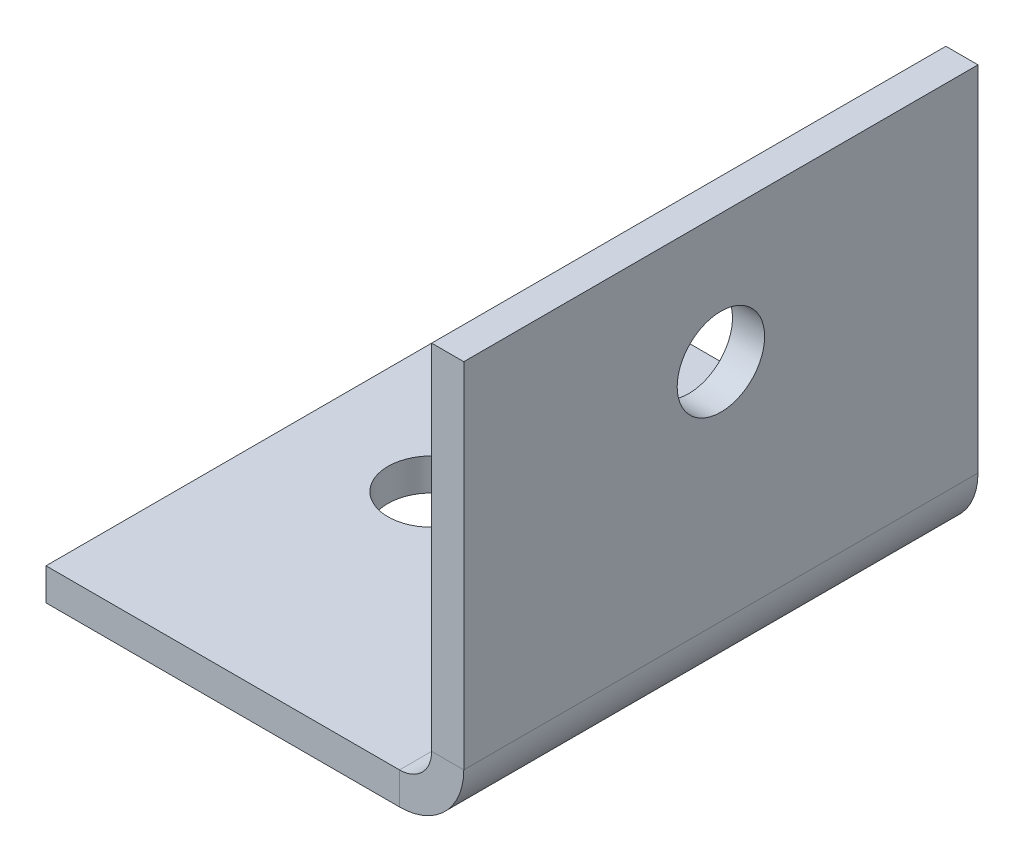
ISO-10303-21;
HEADER;
FILE_DESCRIPTION(('STEP AP214'),'2;1');
FILE_NAME('part.step','',(''),(''),'','','');
FILE_SCHEMA(('AUTOMOTIVE_DESIGN { 1 0 10303 214 1 1 1 1 }'));
ENDSEC;
DATA;
#1=APPLICATION_CONTEXT('core data for automotive mechanical design processes');
#2=APPLICATION_PROTOCOL_DEFINITION('international standard','automotive_design',2000,#1);
#3=PRODUCT_CONTEXT('',#1,'mechanical');
#4=PRODUCT('Part','Part','',(#3));
#5=PRODUCT_RELATED_PRODUCT_CATEGORY('part','',(#4));
#6=PRODUCT_DEFINITION_FORMATION('','',#4);
#7=PRODUCT_DEFINITION_CONTEXT('part definition',#1,'design');
#8=PRODUCT_DEFINITION('design','',#6,#7);
#9=PRODUCT_DEFINITION_SHAPE('','',#8);
#10=(LENGTH_UNIT() NAMED_UNIT(*) SI_UNIT(.MILLI.,.METRE.));
#11=(NAMED_UNIT(*) PLANE_ANGLE_UNIT() SI_UNIT($,.RADIAN.));
#12=(NAMED_UNIT(*) SI_UNIT($,.STERADIAN.) SOLID_ANGLE_UNIT());
#13=UNCERTAINTY_MEASURE_WITH_UNIT(LENGTH_MEASURE(1.E-05),#10,'distance_accuracy_value','');
#14=(GEOMETRIC_REPRESENTATION_CONTEXT(3) GLOBAL_UNCERTAINTY_ASSIGNED_CONTEXT((#13)) GLOBAL_UNIT_ASSIGNED_CONTEXT((#10,
#11,#12)) REPRESENTATION_CONTEXT('',''));
#15=CARTESIAN_POINT('',(0.,0.,0.));
#16=DIRECTION('',(0.,0.,1.));
#17=DIRECTION('',(1.,0.,0.));
#18=AXIS2_PLACEMENT_3D('',#15,#16,#17);
#19=CARTESIAN_POINT('',(27.5,0.,-40.));
#20=DIRECTION('',(0.,0.,-1.));
#21=DIRECTION('',(-1.,0.,0.));
#22=AXIS2_PLACEMENT_3D('',#19,#20,#21);
#23=PLANE('',#22);
#24=DIRECTION('',(0.,-1.,0.));
#25=VECTOR('',#24,1.);
#26=CARTESIAN_POINT('',(27.5,0.,-40.));
#27=LINE('',#26,#25);
#28=CARTESIAN_POINT('',(27.5,0.,-40.));
#29=VERTEX_POINT('',#28);
#30=CARTESIAN_POINT('',(27.5,-2.5,-40.));
#31=VERTEX_POINT('',#30);
#32=EDGE_CURVE('E11',#29,#31,#27,.T.);
#33=ORIENTED_EDGE('',*,*,#32,.F.);
#34=CARTESIAN_POINT('',(27.5,2.5,-40.));
#35=DIRECTION('',(0.,0.,-1.));
#36=DIRECTION('',(-1.,0.,0.));
#37=AXIS2_PLACEMENT_3D('',#34,#35,#36);
#38=CIRCLE('',#37,2.5);
#39=CARTESIAN_POINT('',(30.,2.5,-40.));
#40=VERTEX_POINT('',#39);
#41=EDGE_CURVE('E173',#29,#40,#38,.F.);
#42=ORIENTED_EDGE('',*,*,#41,.T.);
#43=DIRECTION('',(-1.,0.,0.));
#44=VECTOR('',#43,1.);
#45=CARTESIAN_POINT('',(32.5,2.5,-40.));
#46=LINE('',#45,#44);
#47=CARTESIAN_POINT('',(32.5,2.5,-40.));
#48=VERTEX_POINT('',#47);
#49=EDGE_CURVE('E51',#48,#40,#46,.T.);
#50=ORIENTED_EDGE('',*,*,#49,.F.);
#51=CARTESIAN_POINT('',(27.5,2.5,-40.));
#52=DIRECTION('',(0.,0.,1.));
#53=DIRECTION('',(1.,0.,0.));
#54=AXIS2_PLACEMENT_3D('',#51,#52,#53);
#55=CIRCLE('',#54,5.);
#56=EDGE_CURVE('E120',#31,#48,#55,.T.);
#57=ORIENTED_EDGE('',*,*,#56,.F.);
#58=EDGE_LOOP('',(#33,#42,#50,#57));
#59=FACE_BOUND('',#58,.T.);
#60=ADVANCED_FACE('F42',(#59),#23,.T.);
#61=CARTESIAN_POINT('',(32.5,2.5,-40.));
#62=DIRECTION('',(0.,0.,-1.));
#63=DIRECTION('',(-1.,0.,0.));
#64=AXIS2_PLACEMENT_3D('',#61,#62,#63);
#65=PLANE('',#64);
#66=DIRECTION('',(1.,0.,0.));
#67=VECTOR('',#66,1.);
#68=CARTESIAN_POINT('',(0.,0.,-40.));
#69=LINE('',#68,#67);
#70=CARTESIAN_POINT('',(0.,0.,-40.));
#71=VERTEX_POINT('',#70);
#72=EDGE_CURVE('E176',#71,#29,#69,.T.);
#73=ORIENTED_EDGE('',*,*,#72,.T.);
#74=ORIENTED_EDGE('',*,*,#32,.T.);
#75=DIRECTION('',(1.,0.,0.));
#76=VECTOR('',#75,1.);
#77=CARTESIAN_POINT('',(0.,-2.5,-40.));
#78=LINE('',#77,#76);
#79=CARTESIAN_POINT('',(0.,-2.5,-40.));
#80=VERTEX_POINT('',#79);
#81=EDGE_CURVE('E182',#80,#31,#78,.T.);
#82=ORIENTED_EDGE('',*,*,#81,.F.);
#83=DIRECTION('',(0.,1.,0.));
#84=VECTOR('',#83,1.);
#85=CARTESIAN_POINT('',(0.,-2.5,-40.));
#86=LINE('',#85,#84);
#87=EDGE_CURVE('E179',#80,#71,#86,.T.);
#88=ORIENTED_EDGE('',*,*,#87,.T.);
#89=EDGE_LOOP('',(#73,#74,#82,#88));
#90=FACE_BOUND('',#89,.T.);
#91=ADVANCED_FACE('F240',(#90),#65,.T.);
#92=CARTESIAN_POINT('',(30.,2.5,0.));
#93=DIRECTION('',(0.,0.,1.));
#94=DIRECTION('',(1.,0.,0.));
#95=AXIS2_PLACEMENT_3D('',#92,#93,#94);
#96=PLANE('',#95);
#97=DIRECTION('',(1.,0.,0.));
#98=VECTOR('',#97,1.);
#99=CARTESIAN_POINT('',(30.,2.5,0.));
#100=LINE('',#99,#98);
#101=CARTESIAN_POINT('',(30.,2.5,0.));
#102=VERTEX_POINT('',#101);
#103=CARTESIAN_POINT('',(32.5,2.5,0.));
#104=VERTEX_POINT('',#103);
#105=EDGE_CURVE('E133',#102,#104,#100,.T.);
#106=ORIENTED_EDGE('',*,*,#105,.F.);
#107=CARTESIAN_POINT('',(27.5,2.5,0.));
#108=DIRECTION('',(0.,0.,-1.));
#109=DIRECTION('',(-1.,0.,0.));
#110=AXIS2_PLACEMENT_3D('',#107,#108,#109);
#111=CIRCLE('',#110,2.5);
#112=CARTESIAN_POINT('',(27.5,0.,0.));
#113=VERTEX_POINT('',#112);
#114=EDGE_CURVE('E147',#113,#102,#111,.F.);
#115=ORIENTED_EDGE('',*,*,#114,.F.);
#116=DIRECTION('',(0.,1.,0.));
#117=VECTOR('',#116,1.);
#118=CARTESIAN_POINT('',(27.5,-2.5,0.));
#119=LINE('',#118,#117);
#120=CARTESIAN_POINT('',(27.5,-2.5,0.));
#121=VERTEX_POINT('',#120);
#122=EDGE_CURVE('E192',#121,#113,#119,.T.);
#123=ORIENTED_EDGE('',*,*,#122,.F.);
#124=CARTESIAN_POINT('',(27.5,2.5,0.));
#125=DIRECTION('',(0.,0.,1.));
#126=DIRECTION('',(1.,0.,0.));
#127=AXIS2_PLACEMENT_3D('',#124,#125,#126);
#128=CIRCLE('',#127,5.);
#129=EDGE_CURVE('E162',#121,#104,#128,.T.);
#130=ORIENTED_EDGE('',*,*,#129,.T.);
#131=EDGE_LOOP('',(#106,#115,#123,#130));
#132=FACE_BOUND('',#131,.T.);
#133=ADVANCED_FACE('F244',(#132),#96,.T.);
#134=CARTESIAN_POINT('',(27.5,-2.5,0.));
#135=DIRECTION('',(0.,0.,1.));
#136=DIRECTION('',(1.,0.,0.));
#137=AXIS2_PLACEMENT_3D('',#134,#135,#136);
#138=PLANE('',#137);
#139=DIRECTION('',(0.,1.,0.));
#140=VECTOR('',#139,1.);
#141=CARTESIAN_POINT('',(30.,0.,0.));
#142=LINE('',#141,#140);
#143=CARTESIAN_POINT('',(30.,30.,0.));
#144=VERTEX_POINT('',#143);
#145=EDGE_CURVE('E130',#102,#144,#142,.T.);
#146=ORIENTED_EDGE('',*,*,#145,.F.);
#147=ORIENTED_EDGE('',*,*,#105,.T.);
#148=DIRECTION('',(0.,1.,0.));
#149=VECTOR('',#148,1.);
#150=CARTESIAN_POINT('',(32.5,0.,0.));
#151=LINE('',#150,#149);
#152=CARTESIAN_POINT('',(32.5,30.,0.));
#153=VERTEX_POINT('',#152);
#154=EDGE_CURVE('E112',#104,#153,#151,.T.);
#155=ORIENTED_EDGE('',*,*,#154,.T.);
#156=DIRECTION('',(1.,0.,0.));
#157=VECTOR('',#156,1.);
#158=CARTESIAN_POINT('',(30.,30.,0.));
#159=LINE('',#158,#157);
#160=EDGE_CURVE('E124',#144,#153,#159,.T.);
#161=ORIENTED_EDGE('',*,*,#160,.F.);
#162=EDGE_LOOP('',(#146,#147,#155,#161));
#163=FACE_BOUND('',#162,.T.);
#164=ADVANCED_FACE('F132',(#163),#138,.T.);
#165=CARTESIAN_POINT('',(32.5,0.,-40.));
#166=DIRECTION('',(1.,0.,0.));
#167=DIRECTION('',(0.,0.,-1.));
#168=AXIS2_PLACEMENT_3D('',#165,#166,#167);
#169=PLANE('',#168);
#170=CARTESIAN_POINT('',(32.5,20.,-20.));
#171=DIRECTION('',(1.,0.,0.));
#172=DIRECTION('',(0.,0.,-1.));
#173=AXIS2_PLACEMENT_3D('',#170,#171,#172);
#174=CIRCLE('',#173,3.39999999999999);
#175=CARTESIAN_POINT('',(32.5,20.,-23.4));
#176=VERTEX_POINT('',#175);
#177=EDGE_CURVE('E264',#176,#176,#174,.T.);
#178=ORIENTED_EDGE('',*,*,#177,.F.);
#179=EDGE_LOOP('',(#178));
#180=FACE_BOUND('',#179,.T.);
#181=ORIENTED_EDGE('',*,*,#154,.F.);
#182=DIRECTION('',(0.,0.,1.));
#183=VECTOR('',#182,1.);
#184=CARTESIAN_POINT('',(32.5,2.5,-40.));
#185=LINE('',#184,#183);
#186=EDGE_CURVE('E189',#48,#104,#185,.T.);
#187=ORIENTED_EDGE('',*,*,#186,.F.);
#188=DIRECTION('',(0.,1.,0.));
#189=VECTOR('',#188,1.);
#190=CARTESIAN_POINT('',(32.5,0.,-40.));
#191=LINE('',#190,#189);
#192=CARTESIAN_POINT('',(32.5,30.,-40.));
#193=VERTEX_POINT('',#192);
#194=EDGE_CURVE('E115',#48,#193,#191,.T.);
#195=ORIENTED_EDGE('',*,*,#194,.T.);
#196=DIRECTION('',(0.,0.,1.));
#197=VECTOR('',#196,1.);
#198=CARTESIAN_POINT('',(32.5,30.,-40.));
#199=LINE('',#198,#197);
#200=EDGE_CURVE('E108',#193,#153,#199,.T.);
#201=ORIENTED_EDGE('',*,*,#200,.T.);
#202=EDGE_LOOP('',(#181,#187,#195,#201));
#203=FACE_BOUND('',#202,.T.);
#204=ADVANCED_FACE('F110',(#180,#203),#169,.T.);
#205=CARTESIAN_POINT('',(27.5,2.5,-40.));
#206=DIRECTION('',(0.,0.,1.));
#207=DIRECTION('',(1.,0.,0.));
#208=AXIS2_PLACEMENT_3D('',#205,#206,#207);
#209=CYLINDRICAL_SURFACE('',#208,5.);
#210=ORIENTED_EDGE('',*,*,#129,.F.);
#211=DIRECTION('',(0.,0.,1.));
#212=VECTOR('',#211,1.);
#213=CARTESIAN_POINT('',(27.5,-2.5,-40.));
#214=LINE('',#213,#212);
#215=EDGE_CURVE('E193',#31,#121,#214,.T.);
#216=ORIENTED_EDGE('',*,*,#215,.F.);
#217=ORIENTED_EDGE('',*,*,#56,.T.);
#218=ORIENTED_EDGE('',*,*,#186,.T.);
#219=EDGE_LOOP('',(#210,#216,#217,#218));
#220=FACE_BOUND('',#219,.T.);
#221=ADVANCED_FACE('F254',(#220),#209,.T.);
#222=CARTESIAN_POINT('',(0.,-2.5,-40.));
#223=DIRECTION('',(0.,-1.,0.));
#224=DIRECTION('',(0.,0.,-1.));
#225=AXIS2_PLACEMENT_3D('',#222,#223,#224);
#226=PLANE('',#225);
#227=CARTESIAN_POINT('',(10.,-2.5,-20.));
#228=DIRECTION('',(0.,-1.,0.));
#229=DIRECTION('',(0.,0.,-1.));
#230=AXIS2_PLACEMENT_3D('',#227,#228,#229);
#231=CIRCLE('',#230,3.39999999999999);
#232=CARTESIAN_POINT('',(10.,-2.5,-23.4));
#233=VERTEX_POINT('',#232);
#234=EDGE_CURVE('E141',#233,#233,#231,.T.);
#235=ORIENTED_EDGE('',*,*,#234,.F.);
#236=EDGE_LOOP('',(#235));
#237=FACE_BOUND('',#236,.T.);
#238=DIRECTION('',(1.,0.,0.));
#239=VECTOR('',#238,1.);
#240=CARTESIAN_POINT('',(0.,-2.5,0.));
#241=LINE('',#240,#239);
#242=CARTESIAN_POINT('',(0.,-2.5,0.));
#243=VERTEX_POINT('',#242);
#244=EDGE_CURVE('E158',#243,#121,#241,.T.);
#245=ORIENTED_EDGE('',*,*,#244,.F.);
#246=DIRECTION('',(0.,0.,1.));
#247=VECTOR('',#246,1.);
#248=CARTESIAN_POINT('',(0.,-2.5,-40.));
#249=LINE('',#248,#247);
#250=EDGE_CURVE('E197',#80,#243,#249,.T.);
#251=ORIENTED_EDGE('',*,*,#250,.F.);
#252=ORIENTED_EDGE('',*,*,#81,.T.);
#253=ORIENTED_EDGE('',*,*,#215,.T.);
#254=EDGE_LOOP('',(#245,#251,#252,#253));
#255=FACE_BOUND('',#254,.T.);
#256=ADVANCED_FACE('F259',(#237,#255),#226,.T.);
#257=CARTESIAN_POINT('',(0.,-2.5,-40.));
#258=DIRECTION('',(1.,0.,0.));
#259=DIRECTION('',(0.,0.,-1.));
#260=AXIS2_PLACEMENT_3D('',#257,#258,#259);
#261=PLANE('',#260);
#262=DIRECTION('',(0.,1.,0.));
#263=VECTOR('',#262,1.);
#264=CARTESIAN_POINT('',(0.,-2.5,0.));
#265=LINE('',#264,#263);
#266=CARTESIAN_POINT('',(0.,0.,0.));
#267=VERTEX_POINT('',#266);
#268=EDGE_CURVE('E155',#243,#267,#265,.T.);
#269=ORIENTED_EDGE('',*,*,#268,.T.);
#270=DIRECTION('',(0.,0.,1.));
#271=VECTOR('',#270,1.);
#272=CARTESIAN_POINT('',(0.,0.,-40.));
#273=LINE('',#272,#271);
#274=EDGE_CURVE('E200',#71,#267,#273,.T.);
#275=ORIENTED_EDGE('',*,*,#274,.F.);
#276=ORIENTED_EDGE('',*,*,#87,.F.);
#277=ORIENTED_EDGE('',*,*,#250,.T.);
#278=EDGE_LOOP('',(#269,#275,#276,#277));
#279=FACE_BOUND('',#278,.T.);
#280=ADVANCED_FACE('F291',(#279),#261,.F.);
#281=CARTESIAN_POINT('',(0.,0.,-40.));
#282=DIRECTION('',(0.,-1.,0.));
#283=DIRECTION('',(0.,0.,-1.));
#284=AXIS2_PLACEMENT_3D('',#281,#282,#283);
#285=PLANE('',#284);
#286=CARTESIAN_POINT('',(10.,0.,-20.));
#287=DIRECTION('',(0.,-1.,0.));
#288=DIRECTION('',(0.,0.,-1.));
#289=AXIS2_PLACEMENT_3D('',#286,#287,#288);
#290=CIRCLE('',#289,3.39999999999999);
#291=CARTESIAN_POINT('',(10.,0.,-23.4));
#292=VERTEX_POINT('',#291);
#293=EDGE_CURVE('E45',#292,#292,#290,.T.);
#294=ORIENTED_EDGE('',*,*,#293,.T.);
#295=EDGE_LOOP('',(#294));
#296=FACE_BOUND('',#295,.T.);
#297=DIRECTION('',(1.,0.,0.));
#298=VECTOR('',#297,1.);
#299=CARTESIAN_POINT('',(0.,0.,0.));
#300=LINE('',#299,#298);
#301=EDGE_CURVE('E151',#267,#113,#300,.T.);
#302=ORIENTED_EDGE('',*,*,#301,.T.);
#303=DIRECTION('',(0.,0.,1.));
#304=VECTOR('',#303,1.);
#305=CARTESIAN_POINT('',(27.5,0.,-40.));
#306=LINE('',#305,#304);
#307=EDGE_CURVE('E204',#29,#113,#306,.T.);
#308=ORIENTED_EDGE('',*,*,#307,.F.);
#309=ORIENTED_EDGE('',*,*,#72,.F.);
#310=ORIENTED_EDGE('',*,*,#274,.T.);
#311=EDGE_LOOP('',(#302,#308,#309,#310));
#312=FACE_BOUND('',#311,.T.);
#313=ADVANCED_FACE('F236',(#296,#312),#285,.F.);
#314=CARTESIAN_POINT('',(27.5,2.5,-40.));
#315=DIRECTION('',(0.,0.,1.));
#316=DIRECTION('',(1.,0.,0.));
#317=AXIS2_PLACEMENT_3D('',#314,#315,#316);
#318=CYLINDRICAL_SURFACE('',#317,2.5);
#319=ORIENTED_EDGE('',*,*,#114,.T.);
#320=DIRECTION('',(0.,0.,1.));
#321=VECTOR('',#320,1.);
#322=CARTESIAN_POINT('',(30.,2.5,-40.));
#323=LINE('',#322,#321);
#324=EDGE_CURVE('E208',#40,#102,#323,.T.);
#325=ORIENTED_EDGE('',*,*,#324,.F.);
#326=ORIENTED_EDGE('',*,*,#41,.F.);
#327=ORIENTED_EDGE('',*,*,#307,.T.);
#328=EDGE_LOOP('',(#319,#325,#326,#327));
#329=FACE_BOUND('',#328,.T.);
#330=ADVANCED_FACE('F224',(#329),#318,.F.);
#331=CARTESIAN_POINT('',(30.,0.,-40.));
#332=DIRECTION('',(1.,0.,0.));
#333=DIRECTION('',(0.,0.,-1.));
#334=AXIS2_PLACEMENT_3D('',#331,#332,#333);
#335=PLANE('',#334);
#336=CARTESIAN_POINT('',(30.,20.,-20.));
#337=DIRECTION('',(-1.,0.,0.));
#338=DIRECTION('',(0.,0.,1.));
#339=AXIS2_PLACEMENT_3D('',#336,#337,#338);
#340=CIRCLE('',#339,3.39999999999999);
#341=CARTESIAN_POINT('',(30.,20.,-16.6));
#342=VERTEX_POINT('',#341);
#343=EDGE_CURVE('E267',#342,#342,#340,.T.);
#344=ORIENTED_EDGE('',*,*,#343,.F.);
#345=EDGE_LOOP('',(#344));
#346=FACE_BOUND('',#345,.T.);
#347=ORIENTED_EDGE('',*,*,#145,.T.);
#348=DIRECTION('',(0.,0.,1.));
#349=VECTOR('',#348,1.);
#350=CARTESIAN_POINT('',(30.,30.,-40.));
#351=LINE('',#350,#349);
#352=CARTESIAN_POINT('',(30.,30.,-40.));
#353=VERTEX_POINT('',#352);
#354=EDGE_CURVE('E119',#353,#144,#351,.T.);
#355=ORIENTED_EDGE('',*,*,#354,.F.);
#356=DIRECTION('',(0.,1.,0.));
#357=VECTOR('',#356,1.);
#358=CARTESIAN_POINT('',(30.,0.,-40.));
#359=LINE('',#358,#357);
#360=EDGE_CURVE('E170',#40,#353,#359,.T.);
#361=ORIENTED_EDGE('',*,*,#360,.F.);
#362=ORIENTED_EDGE('',*,*,#324,.T.);
#363=EDGE_LOOP('',(#347,#355,#361,#362));
#364=FACE_BOUND('',#363,.T.);
#365=ADVANCED_FACE('F227',(#346,#364),#335,.F.);
#366=CARTESIAN_POINT('',(30.,30.,-40.));
#367=DIRECTION('',(0.,-1.,0.));
#368=DIRECTION('',(0.,0.,-1.));
#369=AXIS2_PLACEMENT_3D('',#366,#367,#368);
#370=PLANE('',#369);
#371=ORIENTED_EDGE('',*,*,#160,.T.);
#372=ORIENTED_EDGE('',*,*,#200,.F.);
#373=DIRECTION('',(1.,0.,0.));
#374=VECTOR('',#373,1.);
#375=CARTESIAN_POINT('',(30.,30.,-40.));
#376=LINE('',#375,#374);
#377=EDGE_CURVE('E167',#353,#193,#376,.T.);
#378=ORIENTED_EDGE('',*,*,#377,.F.);
#379=ORIENTED_EDGE('',*,*,#354,.T.);
#380=EDGE_LOOP('',(#371,#372,#378,#379));
#381=FACE_BOUND('',#380,.T.);
#382=ADVANCED_FACE('F125',(#381),#370,.F.);
#383=CARTESIAN_POINT('',(27.5,2.5,-40.));
#384=DIRECTION('',(0.,0.,-1.));
#385=DIRECTION('',(-1.,0.,0.));
#386=AXIS2_PLACEMENT_3D('',#383,#384,#385);
#387=PLANE('',#386);
#388=ORIENTED_EDGE('',*,*,#194,.F.);
#389=ORIENTED_EDGE('',*,*,#49,.T.);
#390=ORIENTED_EDGE('',*,*,#360,.T.);
#391=ORIENTED_EDGE('',*,*,#377,.T.);
#392=EDGE_LOOP('',(#388,#389,#390,#391));
#393=FACE_BOUND('',#392,.T.);
#394=ADVANCED_FACE('F219',(#393),#387,.T.);
#395=CARTESIAN_POINT('',(27.5,2.5,0.));
#396=DIRECTION('',(0.,0.,-1.));
#397=DIRECTION('',(-1.,0.,0.));
#398=AXIS2_PLACEMENT_3D('',#395,#396,#397);
#399=PLANE('',#398);
#400=ORIENTED_EDGE('',*,*,#244,.T.);
#401=ORIENTED_EDGE('',*,*,#122,.T.);
#402=ORIENTED_EDGE('',*,*,#301,.F.);
#403=ORIENTED_EDGE('',*,*,#268,.F.);
#404=EDGE_LOOP('',(#400,#401,#402,#403));
#405=FACE_BOUND('',#404,.T.);
#406=ADVANCED_FACE('F280',(#405),#399,.F.);
#407=CARTESIAN_POINT('',(10.,-2.5,-20.));
#408=DIRECTION('',(0.,-1.,0.));
#409=DIRECTION('',(0.,0.,-1.));
#410=AXIS2_PLACEMENT_3D('',#407,#408,#409);
#411=CYLINDRICAL_SURFACE('',#410,3.39999999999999);
#412=ORIENTED_EDGE('',*,*,#234,.T.);
#413=EDGE_LOOP('',(#412));
#414=FACE_BOUND('',#413,.T.);
#415=ORIENTED_EDGE('',*,*,#293,.F.);
#416=EDGE_LOOP('',(#415));
#417=FACE_BOUND('',#416,.T.);
#418=ADVANCED_FACE('F275',(#414,#417),#411,.F.);
#419=CARTESIAN_POINT('',(30.,20.,-20.));
#420=DIRECTION('',(-1.,0.,0.));
#421=DIRECTION('',(0.,0.,1.));
#422=AXIS2_PLACEMENT_3D('',#419,#420,#421);
#423=CYLINDRICAL_SURFACE('',#422,3.39999999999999);
#424=ORIENTED_EDGE('',*,*,#177,.T.);
#425=EDGE_LOOP('',(#424));
#426=FACE_BOUND('',#425,.T.);
#427=ORIENTED_EDGE('',*,*,#343,.T.);
#428=EDGE_LOOP('',(#427));
#429=FACE_BOUND('',#428,.T.);
#430=ADVANCED_FACE('F273',(#426,#429),#423,.F.);
#431=CLOSED_SHELL('',(#60,#91,#133,#164,#204,#221,#256,#280,#313,#330,#365,#382,#394,#406,#418,#430));
#432=MANIFOLD_SOLID_BREP('B2',#431);
#433=ADVANCED_BREP_SHAPE_REPRESENTATION('',(#18,#432),#14);
#434=SHAPE_DEFINITION_REPRESENTATION(#9,#433);
ENDSEC;
END-ISO-10303-21;
